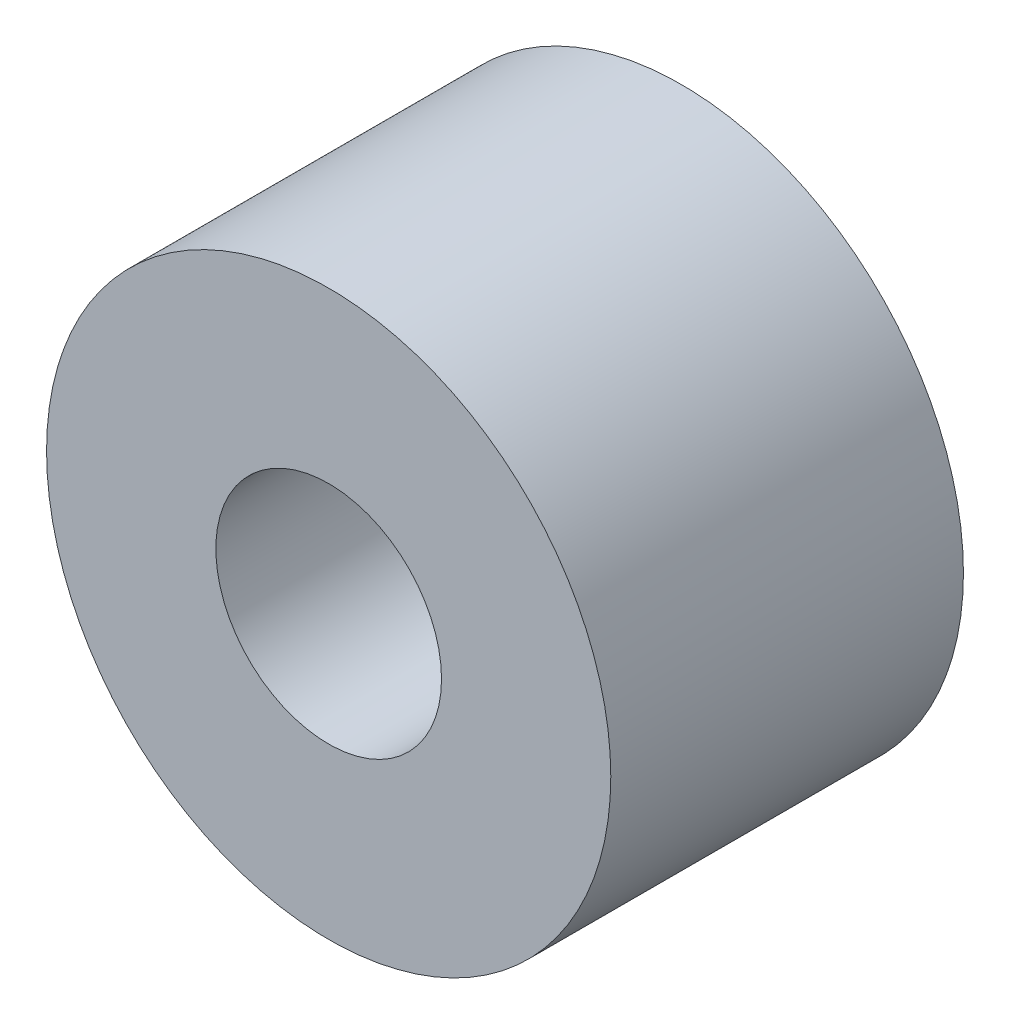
from build123d import *

# Parameters (mm, degrees)
CROQUIS1_R              = 4
SALIENTE_EXTRUIR1_DEPTH = 5
CROQUIS2_R              = 1.6
CORTAR_EXTRUIR1_DEPTH   = 5


with BuildPart() as part:
    # Croquis1 → Saliente-Extruir1 (new body)
    with BuildSketch(Plane.XY):
        Circle(CROQUIS1_R)
    extrude(amount=-SALIENTE_EXTRUIR1_DEPTH)

    # Croquis2 → Cortar-Extruir1 (cut)
    with BuildSketch(Plane.XY):
        Circle(CROQUIS2_R)
    extrude(amount=-CORTAR_EXTRUIR1_DEPTH, mode=Mode.SUBTRACT)


solid = part.part
